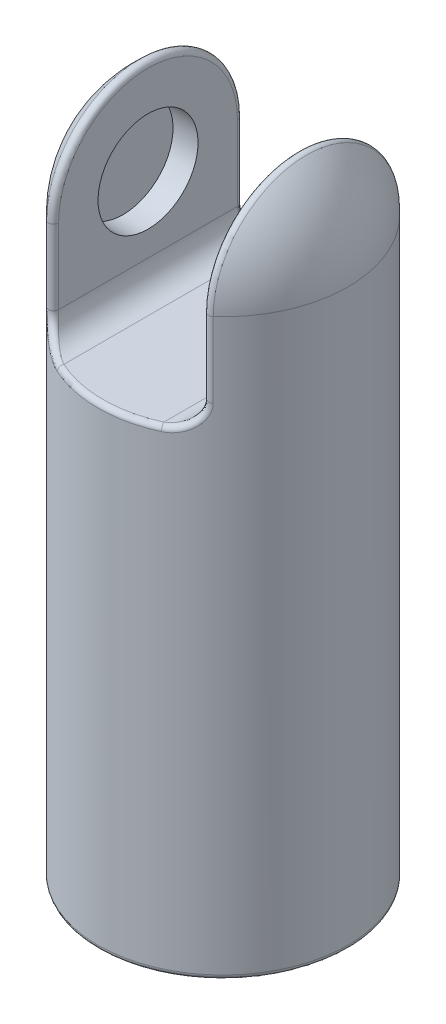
from build123d import *

# Parameters (mm, degrees)
CUT_EXTRUDE1_DEPTH      = 19.934096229
CUT_EXTRUDE2_DEPTH      = 2
CUT_EXTRUDE2_DEPTH_BACK = 2
SKETCH4_R               = 1
FILLET1_R               = 0.1
FILLET2_R               = 0.1


with BuildPart() as part:
    # Sketch2 → Revolve1 (revolve)
    with BuildSketch(Plane.XY, mode=Mode.PRIVATE) as revolve1_sk:
        with BuildLine():
            Line((0, 0), (2.5, 0))
            Line((2.5, 0), (2.5, 11.5))
            ThreePointArc((2.5, 11.5), (1.767766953, 13.267766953), (0, 14))
            Line((0, 14), (0, 0))
        make_face()
    revolve(revolve1_sk.sketch.rotate(Axis((0, 2.995219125, 0), (0, -1, 0)), 90), axis=Axis((0, 2.995219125, 0), (0, -1, 0)))

    # Sketch3 → Cut-Extrude1 (cut, through all)
    with BuildSketch(Plane.XY.offset(10)):
        with BuildLine():
            Line((-1.5, 13.5), (-1.5, 10))
            ThreePointArc((-1.5, 10), (-1.353553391, 9.646446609), (-1, 9.5))
            Line((-1, 9.5), (1, 9.5))
            ThreePointArc((1, 9.5), (1.353553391, 9.646446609), (1.5, 10))
            Line((1.5, 10), (1.5, 13.5))
            ThreePointArc((1.5, 13.5), (0, 14), (-1.5, 13.5))
        make_face()
    extrude(amount=-CUT_EXTRUDE1_DEPTH, mode=Mode.SUBTRACT)

    # Sketch4 → Cut-Extrude2 (cut, two sides: drawn at the far end of the back side and taken through both)
    with BuildSketch(Plane(origin=(0, 0, 0), x_dir=(0, 0, -1), z_dir=(1, 0, 0)).offset(-CUT_EXTRUDE2_DEPTH_BACK)):
        with Locations(Location((0, 11.5, 0), (0, 0, 90))):
            Circle(SKETCH4_R)
    extrude(amount=CUT_EXTRUDE2_DEPTH + CUT_EXTRUDE2_DEPTH_BACK, mode=Mode.SUBTRACT)

    # Fillet1
    fillet1_edges = [part.edges().sort_by_distance(p)[0] for p in [
        (1.5, 13.5, 0),
        (-1.5, 13.5, 0),
        (0, 9.5, -2.5),
        (-1.344745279, 9.637852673, -2.107524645),
        (1.344745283, 9.637852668, 2.107524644),
        (-0.510774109, 9.5, 2.447265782),
        (-1.344745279, 9.637852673, 2.107524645),
        (1.344745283, 9.637852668, -2.107524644),
        (-1.5, 10.75, 2),
        (-1.5, 10.75, -2),
        (1.5, 10.75, -2),
        (1.5, 10.75, 2),
    ]]
    fillet(fillet1_edges, radius=FILLET1_R)

    # Fillet2
    fillet2_edges = [part.edges().sort_by_distance(p)[0] for p in [
        (0, 0, -2.5),
    ]]
    fillet(fillet2_edges, radius=FILLET2_R)


solid = part.part
